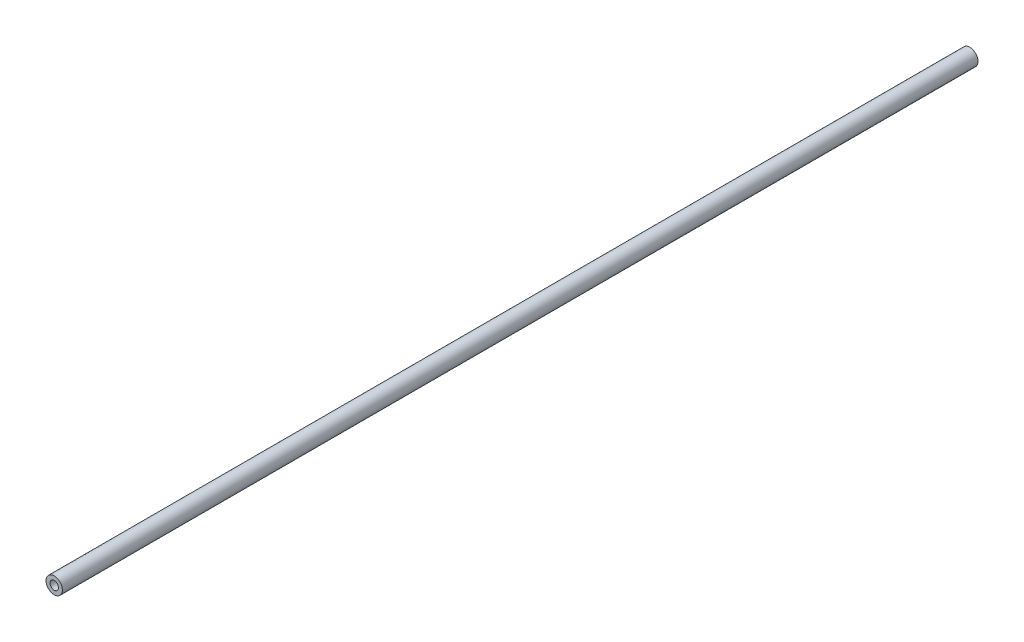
from build123d import *

# Parameters (mm, degrees)
SKETCH1_R                      = 5
BOSS_EXTRUDE1_DEPTH            = 559
F_6_0_204_DIAMETER_HOLE1_D     = 5.1816
F_6_0_204_DIAMETER_HOLE1_DEPTH = 30
F_6_0_204_DIAMETER_HOLE1_TIP   = 1.556709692
F_6_0_204_DIAMETER_HOLE2_D     = 5.1816
F_6_0_204_DIAMETER_HOLE2_DEPTH = 30
F_6_0_204_DIAMETER_HOLE2_TIP   = 1.556709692


with BuildPart() as part:
    # Sketch1 → Boss-Extrude1 (new body)
    with BuildSketch(Plane.XY):
        with Locations(Location((0, 0, 0), (0, 0, 180))):
            Circle(SKETCH1_R)
    extrude(amount=BOSS_EXTRUDE1_DEPTH)

    # 6 _0.204_ Diameter Hole1
    with Locations(Plane(origin=(0, 0, 0), x_dir=(-1, 0, 0), z_dir=(0, 0, -1))):
        with Locations((0, 0)):
            Hole(F_6_0_204_DIAMETER_HOLE1_D / 2, depth=F_6_0_204_DIAMETER_HOLE1_DEPTH)
            with Locations((0, 0, -(F_6_0_204_DIAMETER_HOLE1_DEPTH + F_6_0_204_DIAMETER_HOLE1_TIP / 2))):  # 118° drill point
                Cone(0, F_6_0_204_DIAMETER_HOLE1_D / 2, F_6_0_204_DIAMETER_HOLE1_TIP, mode=Mode.SUBTRACT)

    # 6 _0.204_ Diameter Hole2
    with Locations(Plane.XY.offset(559)):
        with Locations((0, 0)):
            Hole(F_6_0_204_DIAMETER_HOLE2_D / 2, depth=F_6_0_204_DIAMETER_HOLE2_DEPTH)
            with Locations((0, 0, -(F_6_0_204_DIAMETER_HOLE2_DEPTH + F_6_0_204_DIAMETER_HOLE2_TIP / 2))):  # 118° drill point
                Cone(0, F_6_0_204_DIAMETER_HOLE2_D / 2, F_6_0_204_DIAMETER_HOLE2_TIP, mode=Mode.SUBTRACT)


solid = part.part
